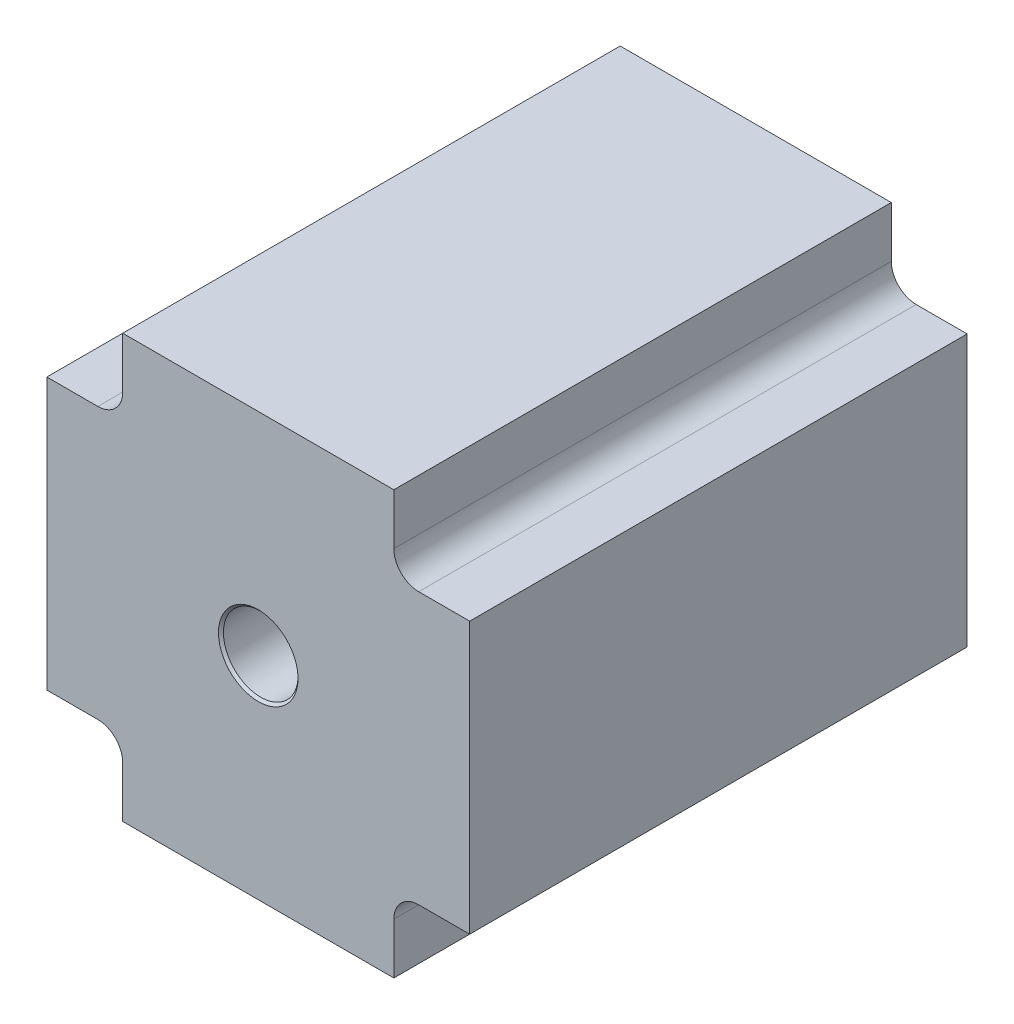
ISO-10303-21;
HEADER;
FILE_DESCRIPTION(('STEP AP214'),'2;1');
FILE_NAME('part.step','',(''),(''),'','','');
FILE_SCHEMA(('AUTOMOTIVE_DESIGN { 1 0 10303 214 1 1 1 1 }'));
ENDSEC;
DATA;
#1=APPLICATION_CONTEXT('core data for automotive mechanical design processes');
#2=APPLICATION_PROTOCOL_DEFINITION('international standard','automotive_design',2000,#1);
#3=PRODUCT_CONTEXT('',#1,'mechanical');
#4=PRODUCT('Part','Part','',(#3));
#5=PRODUCT_RELATED_PRODUCT_CATEGORY('part','',(#4));
#6=PRODUCT_DEFINITION_FORMATION('','',#4);
#7=PRODUCT_DEFINITION_CONTEXT('part definition',#1,'design');
#8=PRODUCT_DEFINITION('design','',#6,#7);
#9=PRODUCT_DEFINITION_SHAPE('','',#8);
#10=(LENGTH_UNIT() NAMED_UNIT(*) SI_UNIT(.MILLI.,.METRE.));
#11=(NAMED_UNIT(*) PLANE_ANGLE_UNIT() SI_UNIT($,.RADIAN.));
#12=(NAMED_UNIT(*) SI_UNIT($,.STERADIAN.) SOLID_ANGLE_UNIT());
#13=UNCERTAINTY_MEASURE_WITH_UNIT(LENGTH_MEASURE(1.E-05),#10,'distance_accuracy_value','');
#14=(GEOMETRIC_REPRESENTATION_CONTEXT(3) GLOBAL_UNCERTAINTY_ASSIGNED_CONTEXT((#13)) GLOBAL_UNIT_ASSIGNED_CONTEXT((#10,
#11,#12)) REPRESENTATION_CONTEXT('',''));
#15=CARTESIAN_POINT('',(0.,0.,0.));
#16=DIRECTION('',(0.,0.,1.));
#17=DIRECTION('',(1.,0.,0.));
#18=AXIS2_PLACEMENT_3D('',#15,#16,#17);
#19=CARTESIAN_POINT('',(-27.25,-27.25,100.));
#20=DIRECTION('',(1.,0.,0.));
#21=DIRECTION('',(0.,1.,0.));
#22=AXIS2_PLACEMENT_3D('',#19,#20,#21);
#23=PLANE('',#22);
#24=DIRECTION('',(0.,-1.,0.));
#25=VECTOR('',#24,1.);
#26=CARTESIAN_POINT('',(-27.25,-27.25,100.));
#27=LINE('',#26,#25);
#28=CARTESIAN_POINT('',(-27.25,-32.25,100.));
#29=VERTEX_POINT('',#28);
#30=CARTESIAN_POINT('',(-27.25,-42.5,100.));
#31=VERTEX_POINT('',#30);
#32=EDGE_CURVE('E149',#29,#31,#27,.T.);
#33=ORIENTED_EDGE('',*,*,#32,.F.);
#34=DIRECTION('',(0.,0.,-1.));
#35=VECTOR('',#34,1.);
#36=CARTESIAN_POINT('',(-27.25,-32.25,0.));
#37=LINE('',#36,#35);
#38=CARTESIAN_POINT('',(-27.25,-32.25,0.));
#39=VERTEX_POINT('',#38);
#40=EDGE_CURVE('E193',#29,#39,#37,.T.);
#41=ORIENTED_EDGE('',*,*,#40,.T.);
#42=DIRECTION('',(0.,-1.,0.));
#43=VECTOR('',#42,1.);
#44=CARTESIAN_POINT('',(-27.25,-27.25,0.));
#45=LINE('',#44,#43);
#46=CARTESIAN_POINT('',(-27.25,-42.5,0.));
#47=VERTEX_POINT('',#46);
#48=EDGE_CURVE('E174',#39,#47,#45,.T.);
#49=ORIENTED_EDGE('',*,*,#48,.T.);
#50=DIRECTION('',(0.,0.,-1.));
#51=VECTOR('',#50,1.);
#52=CARTESIAN_POINT('',(-27.25,-42.5,100.));
#53=LINE('',#52,#51);
#54=EDGE_CURVE('E167',#31,#47,#53,.T.);
#55=ORIENTED_EDGE('',*,*,#54,.F.);
#56=EDGE_LOOP('',(#33,#41,#49,#55));
#57=FACE_BOUND('',#56,.T.);
#58=ADVANCED_FACE('F37',(#57),#23,.F.);
#59=CARTESIAN_POINT('',(27.25,-42.5,100.));
#60=DIRECTION('',(0.,1.,0.));
#61=DIRECTION('',(-1.,0.,0.));
#62=AXIS2_PLACEMENT_3D('',#59,#60,#61);
#63=PLANE('',#62);
#64=DIRECTION('',(1.,0.,0.));
#65=VECTOR('',#64,1.);
#66=CARTESIAN_POINT('',(27.25,-42.5,0.));
#67=LINE('',#66,#65);
#68=CARTESIAN_POINT('',(27.25,-42.5,0.));
#69=VERTEX_POINT('',#68);
#70=EDGE_CURVE('E292',#47,#69,#67,.T.);
#71=ORIENTED_EDGE('',*,*,#70,.T.);
#72=DIRECTION('',(0.,0.,-1.));
#73=VECTOR('',#72,1.);
#74=CARTESIAN_POINT('',(27.25,-42.5,100.));
#75=LINE('',#74,#73);
#76=CARTESIAN_POINT('',(27.25,-42.5,100.));
#77=VERTEX_POINT('',#76);
#78=EDGE_CURVE('E169',#77,#69,#75,.T.);
#79=ORIENTED_EDGE('',*,*,#78,.F.);
#80=DIRECTION('',(1.,0.,0.));
#81=VECTOR('',#80,1.);
#82=CARTESIAN_POINT('',(27.25,-42.5,100.));
#83=LINE('',#82,#81);
#84=EDGE_CURVE('E154',#31,#77,#83,.T.);
#85=ORIENTED_EDGE('',*,*,#84,.F.);
#86=ORIENTED_EDGE('',*,*,#54,.T.);
#87=EDGE_LOOP('',(#71,#79,#85,#86));
#88=FACE_BOUND('',#87,.T.);
#89=ADVANCED_FACE('F166',(#88),#63,.F.);
#90=CARTESIAN_POINT('',(27.25,-27.25,100.));
#91=DIRECTION('',(-1.,0.,0.));
#92=DIRECTION('',(0.,0.,1.));
#93=AXIS2_PLACEMENT_3D('',#90,#91,#92);
#94=PLANE('',#93);
#95=DIRECTION('',(0.,1.,0.));
#96=VECTOR('',#95,1.);
#97=CARTESIAN_POINT('',(27.25,-27.25,0.));
#98=LINE('',#97,#96);
#99=CARTESIAN_POINT('',(27.25,-32.25,0.));
#100=VERTEX_POINT('',#99);
#101=EDGE_CURVE('E291',#69,#100,#98,.T.);
#102=ORIENTED_EDGE('',*,*,#101,.T.);
#103=DIRECTION('',(0.,0.,-1.));
#104=VECTOR('',#103,1.);
#105=CARTESIAN_POINT('',(27.25,-32.25,100.));
#106=LINE('',#105,#104);
#107=CARTESIAN_POINT('',(27.25,-32.25,100.));
#108=VERTEX_POINT('',#107);
#109=EDGE_CURVE('E200',#100,#108,#106,.F.);
#110=ORIENTED_EDGE('',*,*,#109,.T.);
#111=DIRECTION('',(0.,1.,0.));
#112=VECTOR('',#111,1.);
#113=CARTESIAN_POINT('',(27.25,-27.25,100.));
#114=LINE('',#113,#112);
#115=EDGE_CURVE('E171',#77,#108,#114,.T.);
#116=ORIENTED_EDGE('',*,*,#115,.F.);
#117=ORIENTED_EDGE('',*,*,#78,.T.);
#118=EDGE_LOOP('',(#102,#110,#116,#117));
#119=FACE_BOUND('',#118,.T.);
#120=ADVANCED_FACE('F317',(#119),#94,.F.);
#121=CARTESIAN_POINT('',(42.5,-27.25,100.));
#122=DIRECTION('',(0.,1.,0.));
#123=DIRECTION('',(0.,0.,1.));
#124=AXIS2_PLACEMENT_3D('',#121,#122,#123);
#125=PLANE('',#124);
#126=DIRECTION('',(1.,0.,0.));
#127=VECTOR('',#126,1.);
#128=CARTESIAN_POINT('',(42.5,-27.25,100.));
#129=LINE('',#128,#127);
#130=CARTESIAN_POINT('',(32.25,-27.25,100.));
#131=VERTEX_POINT('',#130);
#132=CARTESIAN_POINT('',(42.5,-27.25,100.));
#133=VERTEX_POINT('',#132);
#134=EDGE_CURVE('E307',#131,#133,#129,.T.);
#135=ORIENTED_EDGE('',*,*,#134,.F.);
#136=DIRECTION('',(0.,0.,-1.));
#137=VECTOR('',#136,1.);
#138=CARTESIAN_POINT('',(32.25,-27.25,0.));
#139=LINE('',#138,#137);
#140=CARTESIAN_POINT('',(32.25,-27.25,0.));
#141=VERTEX_POINT('',#140);
#142=EDGE_CURVE('E197',#131,#141,#139,.T.);
#143=ORIENTED_EDGE('',*,*,#142,.T.);
#144=DIRECTION('',(1.,0.,0.));
#145=VECTOR('',#144,1.);
#146=CARTESIAN_POINT('',(42.5,-27.25,0.));
#147=LINE('',#146,#145);
#148=CARTESIAN_POINT('',(42.5,-27.25,0.));
#149=VERTEX_POINT('',#148);
#150=EDGE_CURVE('E256',#141,#149,#147,.T.);
#151=ORIENTED_EDGE('',*,*,#150,.T.);
#152=DIRECTION('',(0.,0.,-1.));
#153=VECTOR('',#152,1.);
#154=CARTESIAN_POINT('',(42.5,-27.25,100.));
#155=LINE('',#154,#153);
#156=EDGE_CURVE('E181',#133,#149,#155,.T.);
#157=ORIENTED_EDGE('',*,*,#156,.F.);
#158=EDGE_LOOP('',(#135,#143,#151,#157));
#159=FACE_BOUND('',#158,.T.);
#160=ADVANCED_FACE('F315',(#159),#125,.F.);
#161=CARTESIAN_POINT('',(42.5,-27.25,100.));
#162=DIRECTION('',(-1.,0.,0.));
#163=DIRECTION('',(0.,0.,1.));
#164=AXIS2_PLACEMENT_3D('',#161,#162,#163);
#165=PLANE('',#164);
#166=DIRECTION('',(0.,1.,0.));
#167=VECTOR('',#166,1.);
#168=CARTESIAN_POINT('',(42.5,-27.25,0.));
#169=LINE('',#168,#167);
#170=CARTESIAN_POINT('',(42.5,27.25,0.));
#171=VERTEX_POINT('',#170);
#172=EDGE_CURVE('E252',#149,#171,#169,.T.);
#173=ORIENTED_EDGE('',*,*,#172,.T.);
#174=DIRECTION('',(0.,0.,-1.));
#175=VECTOR('',#174,1.);
#176=CARTESIAN_POINT('',(42.5,27.25,100.));
#177=LINE('',#176,#175);
#178=CARTESIAN_POINT('',(42.5,27.25,100.));
#179=VERTEX_POINT('',#178);
#180=EDGE_CURVE('E251',#179,#171,#177,.T.);
#181=ORIENTED_EDGE('',*,*,#180,.F.);
#182=DIRECTION('',(0.,1.,0.));
#183=VECTOR('',#182,1.);
#184=CARTESIAN_POINT('',(42.5,-27.25,100.));
#185=LINE('',#184,#183);
#186=EDGE_CURVE('E285',#133,#179,#185,.T.);
#187=ORIENTED_EDGE('',*,*,#186,.F.);
#188=ORIENTED_EDGE('',*,*,#156,.T.);
#189=EDGE_LOOP('',(#173,#181,#187,#188));
#190=FACE_BOUND('',#189,.T.);
#191=ADVANCED_FACE('F284',(#190),#165,.F.);
#192=CARTESIAN_POINT('',(42.5,27.25,100.));
#193=DIRECTION('',(0.,-1.,0.));
#194=DIRECTION('',(1.,0.,0.));
#195=AXIS2_PLACEMENT_3D('',#192,#193,#194);
#196=PLANE('',#195);
#197=DIRECTION('',(-1.,0.,0.));
#198=VECTOR('',#197,1.);
#199=CARTESIAN_POINT('',(42.5,27.25,0.));
#200=LINE('',#199,#198);
#201=CARTESIAN_POINT('',(32.25,27.25,0.));
#202=VERTEX_POINT('',#201);
#203=EDGE_CURVE('E244',#171,#202,#200,.T.);
#204=ORIENTED_EDGE('',*,*,#203,.T.);
#205=DIRECTION('',(0.,0.,-1.));
#206=VECTOR('',#205,1.);
#207=CARTESIAN_POINT('',(32.25,27.25,100.));
#208=LINE('',#207,#206);
#209=CARTESIAN_POINT('',(32.25,27.25,100.));
#210=VERTEX_POINT('',#209);
#211=EDGE_CURVE('E205',#202,#210,#208,.F.);
#212=ORIENTED_EDGE('',*,*,#211,.T.);
#213=DIRECTION('',(-1.,0.,0.));
#214=VECTOR('',#213,1.);
#215=CARTESIAN_POINT('',(42.5,27.25,100.));
#216=LINE('',#215,#214);
#217=EDGE_CURVE('E227',#179,#210,#216,.T.);
#218=ORIENTED_EDGE('',*,*,#217,.F.);
#219=ORIENTED_EDGE('',*,*,#180,.T.);
#220=EDGE_LOOP('',(#204,#212,#218,#219));
#221=FACE_BOUND('',#220,.T.);
#222=ADVANCED_FACE('F249',(#221),#196,.F.);
#223=CARTESIAN_POINT('',(27.25,42.5,100.));
#224=DIRECTION('',(-1.,0.,0.));
#225=DIRECTION('',(0.,-1.,0.));
#226=AXIS2_PLACEMENT_3D('',#223,#224,#225);
#227=PLANE('',#226);
#228=DIRECTION('',(0.,1.,0.));
#229=VECTOR('',#228,1.);
#230=CARTESIAN_POINT('',(27.25,42.5,100.));
#231=LINE('',#230,#229);
#232=CARTESIAN_POINT('',(27.25,32.25,100.));
#233=VERTEX_POINT('',#232);
#234=CARTESIAN_POINT('',(27.25,42.5,100.));
#235=VERTEX_POINT('',#234);
#236=EDGE_CURVE('E224',#233,#235,#231,.T.);
#237=ORIENTED_EDGE('',*,*,#236,.F.);
#238=DIRECTION('',(0.,0.,-1.));
#239=VECTOR('',#238,1.);
#240=CARTESIAN_POINT('',(27.25,32.25,0.));
#241=LINE('',#240,#239);
#242=CARTESIAN_POINT('',(27.25,32.25,0.));
#243=VERTEX_POINT('',#242);
#244=EDGE_CURVE('E202',#233,#243,#241,.T.);
#245=ORIENTED_EDGE('',*,*,#244,.T.);
#246=DIRECTION('',(0.,1.,0.));
#247=VECTOR('',#246,1.);
#248=CARTESIAN_POINT('',(27.25,42.5,0.));
#249=LINE('',#248,#247);
#250=CARTESIAN_POINT('',(27.25,42.5,0.));
#251=VERTEX_POINT('',#250);
#252=EDGE_CURVE('E246',#243,#251,#249,.T.);
#253=ORIENTED_EDGE('',*,*,#252,.T.);
#254=DIRECTION('',(0.,0.,-1.));
#255=VECTOR('',#254,1.);
#256=CARTESIAN_POINT('',(27.25,42.5,100.));
#257=LINE('',#256,#255);
#258=EDGE_CURVE('E235',#235,#251,#257,.T.);
#259=ORIENTED_EDGE('',*,*,#258,.F.);
#260=EDGE_LOOP('',(#237,#245,#253,#259));
#261=FACE_BOUND('',#260,.T.);
#262=ADVANCED_FACE('F232',(#261),#227,.F.);
#263=CARTESIAN_POINT('',(27.25,42.5,100.));
#264=DIRECTION('',(0.,-1.,0.));
#265=DIRECTION('',(1.,0.,0.));
#266=AXIS2_PLACEMENT_3D('',#263,#264,#265);
#267=PLANE('',#266);
#268=DIRECTION('',(-1.,0.,0.));
#269=VECTOR('',#268,1.);
#270=CARTESIAN_POINT('',(27.25,42.5,0.));
#271=LINE('',#270,#269);
#272=CARTESIAN_POINT('',(-27.25,42.5,0.));
#273=VERTEX_POINT('',#272);
#274=EDGE_CURVE('E254',#251,#273,#271,.T.);
#275=ORIENTED_EDGE('',*,*,#274,.T.);
#276=DIRECTION('',(0.,0.,-1.));
#277=VECTOR('',#276,1.);
#278=CARTESIAN_POINT('',(-27.25,42.5,100.));
#279=LINE('',#278,#277);
#280=CARTESIAN_POINT('',(-27.25,42.5,100.));
#281=VERTEX_POINT('',#280);
#282=EDGE_CURVE('E276',#281,#273,#279,.T.);
#283=ORIENTED_EDGE('',*,*,#282,.F.);
#284=DIRECTION('',(-1.,0.,0.));
#285=VECTOR('',#284,1.);
#286=CARTESIAN_POINT('',(27.25,42.5,100.));
#287=LINE('',#286,#285);
#288=EDGE_CURVE('E237',#235,#281,#287,.T.);
#289=ORIENTED_EDGE('',*,*,#288,.F.);
#290=ORIENTED_EDGE('',*,*,#258,.T.);
#291=EDGE_LOOP('',(#275,#283,#289,#290));
#292=FACE_BOUND('',#291,.T.);
#293=ADVANCED_FACE('F385',(#292),#267,.F.);
#294=CARTESIAN_POINT('',(-27.25,42.5,100.));
#295=DIRECTION('',(1.,0.,0.));
#296=DIRECTION('',(0.,0.,-1.));
#297=AXIS2_PLACEMENT_3D('',#294,#295,#296);
#298=PLANE('',#297);
#299=DIRECTION('',(0.,-1.,0.));
#300=VECTOR('',#299,1.);
#301=CARTESIAN_POINT('',(-27.25,42.5,0.));
#302=LINE('',#301,#300);
#303=CARTESIAN_POINT('',(-27.25,32.25,0.));
#304=VERTEX_POINT('',#303);
#305=EDGE_CURVE('E261',#273,#304,#302,.T.);
#306=ORIENTED_EDGE('',*,*,#305,.T.);
#307=DIRECTION('',(0.,0.,-1.));
#308=VECTOR('',#307,1.);
#309=CARTESIAN_POINT('',(-27.25,32.25,100.));
#310=LINE('',#309,#308);
#311=CARTESIAN_POINT('',(-27.25,32.25,100.));
#312=VERTEX_POINT('',#311);
#313=EDGE_CURVE('E52',#304,#312,#310,.F.);
#314=ORIENTED_EDGE('',*,*,#313,.T.);
#315=DIRECTION('',(0.,-1.,0.));
#316=VECTOR('',#315,1.);
#317=CARTESIAN_POINT('',(-27.25,42.5,100.));
#318=LINE('',#317,#316);
#319=EDGE_CURVE('E302',#281,#312,#318,.T.);
#320=ORIENTED_EDGE('',*,*,#319,.F.);
#321=ORIENTED_EDGE('',*,*,#282,.T.);
#322=EDGE_LOOP('',(#306,#314,#320,#321));
#323=FACE_BOUND('',#322,.T.);
#324=ADVANCED_FACE('F382',(#323),#298,.F.);
#325=CARTESIAN_POINT('',(-27.25,27.25,100.));
#326=DIRECTION('',(0.,-1.,0.));
#327=DIRECTION('',(0.,0.,-1.));
#328=AXIS2_PLACEMENT_3D('',#325,#326,#327);
#329=PLANE('',#328);
#330=DIRECTION('',(-1.,0.,0.));
#331=VECTOR('',#330,1.);
#332=CARTESIAN_POINT('',(-27.25,27.25,100.));
#333=LINE('',#332,#331);
#334=CARTESIAN_POINT('',(-32.25,27.25,100.));
#335=VERTEX_POINT('',#334);
#336=CARTESIAN_POINT('',(-42.5,27.25,100.));
#337=VERTEX_POINT('',#336);
#338=EDGE_CURVE('E300',#335,#337,#333,.T.);
#339=ORIENTED_EDGE('',*,*,#338,.F.);
#340=DIRECTION('',(0.,0.,-1.));
#341=VECTOR('',#340,1.);
#342=CARTESIAN_POINT('',(-32.25,27.25,0.));
#343=LINE('',#342,#341);
#344=CARTESIAN_POINT('',(-32.25,27.25,0.));
#345=VERTEX_POINT('',#344);
#346=EDGE_CURVE('E207',#335,#345,#343,.T.);
#347=ORIENTED_EDGE('',*,*,#346,.T.);
#348=DIRECTION('',(-1.,0.,0.));
#349=VECTOR('',#348,1.);
#350=CARTESIAN_POINT('',(-27.25,27.25,0.));
#351=LINE('',#350,#349);
#352=CARTESIAN_POINT('',(-42.5,27.25,0.));
#353=VERTEX_POINT('',#352);
#354=EDGE_CURVE('E263',#345,#353,#351,.T.);
#355=ORIENTED_EDGE('',*,*,#354,.T.);
#356=DIRECTION('',(0.,0.,-1.));
#357=VECTOR('',#356,1.);
#358=CARTESIAN_POINT('',(-42.5,27.25,100.));
#359=LINE('',#358,#357);
#360=EDGE_CURVE('E272',#337,#353,#359,.T.);
#361=ORIENTED_EDGE('',*,*,#360,.F.);
#362=EDGE_LOOP('',(#339,#347,#355,#361));
#363=FACE_BOUND('',#362,.T.);
#364=ADVANCED_FACE('F358',(#363),#329,.F.);
#365=CARTESIAN_POINT('',(-42.5,-27.25,100.));
#366=DIRECTION('',(1.,0.,0.));
#367=DIRECTION('',(0.,0.,-1.));
#368=AXIS2_PLACEMENT_3D('',#365,#366,#367);
#369=PLANE('',#368);
#370=DIRECTION('',(0.,-1.,0.));
#371=VECTOR('',#370,1.);
#372=CARTESIAN_POINT('',(-42.5,-27.25,0.));
#373=LINE('',#372,#371);
#374=CARTESIAN_POINT('',(-42.5,-27.25,0.));
#375=VERTEX_POINT('',#374);
#376=EDGE_CURVE('E265',#353,#375,#373,.T.);
#377=ORIENTED_EDGE('',*,*,#376,.T.);
#378=DIRECTION('',(0.,0.,-1.));
#379=VECTOR('',#378,1.);
#380=CARTESIAN_POINT('',(-42.5,-27.25,100.));
#381=LINE('',#380,#379);
#382=CARTESIAN_POINT('',(-42.5,-27.25,100.));
#383=VERTEX_POINT('',#382);
#384=EDGE_CURVE('E269',#383,#375,#381,.T.);
#385=ORIENTED_EDGE('',*,*,#384,.F.);
#386=DIRECTION('',(0.,-1.,0.));
#387=VECTOR('',#386,1.);
#388=CARTESIAN_POINT('',(-42.5,-27.25,100.));
#389=LINE('',#388,#387);
#390=EDGE_CURVE('E298',#337,#383,#389,.T.);
#391=ORIENTED_EDGE('',*,*,#390,.F.);
#392=ORIENTED_EDGE('',*,*,#360,.T.);
#393=EDGE_LOOP('',(#377,#385,#391,#392));
#394=FACE_BOUND('',#393,.T.);
#395=ADVANCED_FACE('F363',(#394),#369,.F.);
#396=CARTESIAN_POINT('',(-27.25,-27.25,100.));
#397=DIRECTION('',(0.,1.,0.));
#398=DIRECTION('',(-1.,0.,0.));
#399=AXIS2_PLACEMENT_3D('',#396,#397,#398);
#400=PLANE('',#399);
#401=DIRECTION('',(1.,0.,0.));
#402=VECTOR('',#401,1.);
#403=CARTESIAN_POINT('',(-27.25,-27.25,0.));
#404=LINE('',#403,#402);
#405=CARTESIAN_POINT('',(-32.25,-27.25,0.));
#406=VERTEX_POINT('',#405);
#407=EDGE_CURVE('E162',#375,#406,#404,.T.);
#408=ORIENTED_EDGE('',*,*,#407,.T.);
#409=DIRECTION('',(0.,0.,-1.));
#410=VECTOR('',#409,1.);
#411=CARTESIAN_POINT('',(-32.25,-27.25,100.));
#412=LINE('',#411,#410);
#413=CARTESIAN_POINT('',(-32.25,-27.25,100.));
#414=VERTEX_POINT('',#413);
#415=EDGE_CURVE('E195',#406,#414,#412,.F.);
#416=ORIENTED_EDGE('',*,*,#415,.T.);
#417=DIRECTION('',(1.,0.,0.));
#418=VECTOR('',#417,1.);
#419=CARTESIAN_POINT('',(-27.25,-27.25,100.));
#420=LINE('',#419,#418);
#421=EDGE_CURVE('E273',#383,#414,#420,.T.);
#422=ORIENTED_EDGE('',*,*,#421,.F.);
#423=ORIENTED_EDGE('',*,*,#384,.T.);
#424=EDGE_LOOP('',(#408,#416,#422,#423));
#425=FACE_BOUND('',#424,.T.);
#426=ADVANCED_FACE('F368',(#425),#400,.F.);
#427=CARTESIAN_POINT('',(0.,0.,100.));
#428=DIRECTION('',(0.,0.,-1.));
#429=DIRECTION('',(-1.,0.,0.));
#430=AXIS2_PLACEMENT_3D('',#427,#428,#429);
#431=PLANE('',#430);
#432=CARTESIAN_POINT('',(0.,0.,100.));
#433=DIRECTION('',(0.,0.,-1.));
#434=DIRECTION('',(-1.,0.,0.));
#435=AXIS2_PLACEMENT_3D('',#432,#433,#434);
#436=CIRCLE('',#435,8.00000000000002);
#437=CARTESIAN_POINT('',(-8.00000000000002,0.,100.));
#438=VERTEX_POINT('',#437);
#439=EDGE_CURVE('E190',#438,#438,#436,.T.);
#440=ORIENTED_EDGE('',*,*,#439,.T.);
#441=EDGE_LOOP('',(#440));
#442=FACE_BOUND('',#441,.T.);
#443=ORIENTED_EDGE('',*,*,#421,.T.);
#444=CARTESIAN_POINT('',(-32.25,-32.25,100.));
#445=DIRECTION('',(0.,0.,-1.));
#446=DIRECTION('',(-1.,0.,0.));
#447=AXIS2_PLACEMENT_3D('',#444,#445,#446);
#448=CIRCLE('',#447,5.);
#449=EDGE_CURVE('E157',#414,#29,#448,.T.);
#450=ORIENTED_EDGE('',*,*,#449,.T.);
#451=ORIENTED_EDGE('',*,*,#32,.T.);
#452=ORIENTED_EDGE('',*,*,#84,.T.);
#453=ORIENTED_EDGE('',*,*,#115,.T.);
#454=CARTESIAN_POINT('',(32.25,-32.25,100.));
#455=DIRECTION('',(0.,0.,-1.));
#456=DIRECTION('',(-1.,0.,0.));
#457=AXIS2_PLACEMENT_3D('',#454,#455,#456);
#458=CIRCLE('',#457,5.);
#459=EDGE_CURVE('E216',#108,#131,#458,.T.);
#460=ORIENTED_EDGE('',*,*,#459,.T.);
#461=ORIENTED_EDGE('',*,*,#134,.T.);
#462=ORIENTED_EDGE('',*,*,#186,.T.);
#463=ORIENTED_EDGE('',*,*,#217,.T.);
#464=CARTESIAN_POINT('',(32.25,32.25,100.));
#465=DIRECTION('',(0.,0.,-1.));
#466=DIRECTION('',(-1.,0.,0.));
#467=AXIS2_PLACEMENT_3D('',#464,#465,#466);
#468=CIRCLE('',#467,5.);
#469=EDGE_CURVE('E220',#210,#233,#468,.T.);
#470=ORIENTED_EDGE('',*,*,#469,.T.);
#471=ORIENTED_EDGE('',*,*,#236,.T.);
#472=ORIENTED_EDGE('',*,*,#288,.T.);
#473=ORIENTED_EDGE('',*,*,#319,.T.);
#474=CARTESIAN_POINT('',(-32.25,32.25,100.));
#475=DIRECTION('',(0.,0.,-1.));
#476=DIRECTION('',(-1.,0.,0.));
#477=AXIS2_PLACEMENT_3D('',#474,#475,#476);
#478=CIRCLE('',#477,5.);
#479=EDGE_CURVE('E11',#312,#335,#478,.T.);
#480=ORIENTED_EDGE('',*,*,#479,.T.);
#481=ORIENTED_EDGE('',*,*,#338,.T.);
#482=ORIENTED_EDGE('',*,*,#390,.T.);
#483=EDGE_LOOP('',(#443,#450,#451,#452,#453,#460,#461,#462,#463,#470,#471,#472,#473,#480,#481,#482));
#484=FACE_BOUND('',#483,.T.);
#485=ADVANCED_FACE('F152',(#442,#484),#431,.F.);
#486=CARTESIAN_POINT('',(0.,0.,0.));
#487=DIRECTION('',(0.,0.,-1.));
#488=DIRECTION('',(-1.,0.,0.));
#489=AXIS2_PLACEMENT_3D('',#486,#487,#488);
#490=PLANE('',#489);
#491=CARTESIAN_POINT('',(0.,0.,0.));
#492=DIRECTION('',(0.,0.,-1.));
#493=DIRECTION('',(-1.,0.,0.));
#494=AXIS2_PLACEMENT_3D('',#491,#492,#493);
#495=CIRCLE('',#494,8.00000000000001);
#496=CARTESIAN_POINT('',(-8.00000000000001,0.,0.));
#497=VERTEX_POINT('',#496);
#498=EDGE_CURVE('E176',#497,#497,#495,.F.);
#499=ORIENTED_EDGE('',*,*,#498,.T.);
#500=EDGE_LOOP('',(#499));
#501=FACE_BOUND('',#500,.T.);
#502=ORIENTED_EDGE('',*,*,#48,.F.);
#503=CARTESIAN_POINT('',(-32.25,-32.25,0.));
#504=DIRECTION('',(0.,0.,-1.));
#505=DIRECTION('',(-1.,0.,0.));
#506=AXIS2_PLACEMENT_3D('',#503,#504,#505);
#507=CIRCLE('',#506,5.);
#508=EDGE_CURVE('E211',#39,#406,#507,.F.);
#509=ORIENTED_EDGE('',*,*,#508,.T.);
#510=ORIENTED_EDGE('',*,*,#407,.F.);
#511=ORIENTED_EDGE('',*,*,#376,.F.);
#512=ORIENTED_EDGE('',*,*,#354,.F.);
#513=CARTESIAN_POINT('',(-32.25,32.25,0.));
#514=DIRECTION('',(0.,0.,-1.));
#515=DIRECTION('',(-1.,0.,0.));
#516=AXIS2_PLACEMENT_3D('',#513,#514,#515);
#517=CIRCLE('',#516,5.);
#518=EDGE_CURVE('E45',#345,#304,#517,.F.);
#519=ORIENTED_EDGE('',*,*,#518,.T.);
#520=ORIENTED_EDGE('',*,*,#305,.F.);
#521=ORIENTED_EDGE('',*,*,#274,.F.);
#522=ORIENTED_EDGE('',*,*,#252,.F.);
#523=CARTESIAN_POINT('',(32.25,32.25,0.));
#524=DIRECTION('',(0.,0.,-1.));
#525=DIRECTION('',(-1.,0.,0.));
#526=AXIS2_PLACEMENT_3D('',#523,#524,#525);
#527=CIRCLE('',#526,5.);
#528=EDGE_CURVE('E218',#243,#202,#527,.F.);
#529=ORIENTED_EDGE('',*,*,#528,.T.);
#530=ORIENTED_EDGE('',*,*,#203,.F.);
#531=ORIENTED_EDGE('',*,*,#172,.F.);
#532=ORIENTED_EDGE('',*,*,#150,.F.);
#533=CARTESIAN_POINT('',(32.25,-32.25,0.));
#534=DIRECTION('',(0.,0.,-1.));
#535=DIRECTION('',(-1.,0.,0.));
#536=AXIS2_PLACEMENT_3D('',#533,#534,#535);
#537=CIRCLE('',#536,5.);
#538=EDGE_CURVE('E214',#141,#100,#537,.F.);
#539=ORIENTED_EDGE('',*,*,#538,.T.);
#540=ORIENTED_EDGE('',*,*,#101,.F.);
#541=ORIENTED_EDGE('',*,*,#70,.F.);
#542=EDGE_LOOP('',(#502,#509,#510,#511,#512,#519,#520,#521,#522,#529,#530,#531,#532,#539,#540,#541));
#543=FACE_BOUND('',#542,.T.);
#544=ADVANCED_FACE('F242',(#501,#543),#490,.T.);
#545=CARTESIAN_POINT('',(0.,0.,0.));
#546=DIRECTION('',(0.,0.,1.));
#547=DIRECTION('',(1.,0.,0.));
#548=AXIS2_PLACEMENT_3D('',#545,#546,#547);
#549=CYLINDRICAL_SURFACE('',#548,7.5);
#550=CARTESIAN_POINT('',(0.,0.,0.500000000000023));
#551=DIRECTION('',(0.,0.,-1.));
#552=DIRECTION('',(-1.,0.,0.));
#553=AXIS2_PLACEMENT_3D('',#550,#551,#552);
#554=CIRCLE('',#553,7.5);
#555=CARTESIAN_POINT('',(-7.5,0.,0.500000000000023));
#556=VERTEX_POINT('',#555);
#557=EDGE_CURVE('E187',#556,#556,#554,.T.);
#558=ORIENTED_EDGE('',*,*,#557,.T.);
#559=EDGE_LOOP('',(#558));
#560=FACE_BOUND('',#559,.T.);
#561=CARTESIAN_POINT('',(0.,0.,99.5));
#562=DIRECTION('',(0.,0.,-1.));
#563=DIRECTION('',(-1.,0.,0.));
#564=AXIS2_PLACEMENT_3D('',#561,#562,#563);
#565=CIRCLE('',#564,7.5);
#566=CARTESIAN_POINT('',(-7.5,0.,99.5));
#567=VERTEX_POINT('',#566);
#568=EDGE_CURVE('E179',#567,#567,#565,.F.);
#569=ORIENTED_EDGE('',*,*,#568,.T.);
#570=EDGE_LOOP('',(#569));
#571=FACE_BOUND('',#570,.T.);
#572=ADVANCED_FACE('F336',(#560,#571),#549,.F.);
#573=CARTESIAN_POINT('',(0.,0.,0.));
#574=DIRECTION('',(0.,0.,-1.));
#575=DIRECTION('',(-1.,0.,0.));
#576=AXIS2_PLACEMENT_3D('',#573,#574,#575);
#577=CONICAL_SURFACE('',#576,8.00000000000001,0.785398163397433);
#578=ORIENTED_EDGE('',*,*,#557,.F.);
#579=EDGE_LOOP('',(#578));
#580=FACE_BOUND('',#579,.T.);
#581=ORIENTED_EDGE('',*,*,#498,.F.);
#582=EDGE_LOOP('',(#581));
#583=FACE_BOUND('',#582,.T.);
#584=ADVANCED_FACE('F332',(#580,#583),#577,.F.);
#585=CARTESIAN_POINT('',(0.,0.,99.5));
#586=DIRECTION('',(0.,0.,1.));
#587=DIRECTION('',(1.,0.,0.));
#588=AXIS2_PLACEMENT_3D('',#585,#586,#587);
#589=CONICAL_SURFACE('',#588,7.5,0.785398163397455);
#590=ORIENTED_EDGE('',*,*,#439,.F.);
#591=EDGE_LOOP('',(#590));
#592=FACE_BOUND('',#591,.T.);
#593=ORIENTED_EDGE('',*,*,#568,.F.);
#594=EDGE_LOOP('',(#593));
#595=FACE_BOUND('',#594,.T.);
#596=ADVANCED_FACE('F335',(#592,#595),#589,.F.);
#597=CARTESIAN_POINT('',(-32.25,-32.25,100.));
#598=DIRECTION('',(0.,0.,1.));
#599=DIRECTION('',(1.,0.,0.));
#600=AXIS2_PLACEMENT_3D('',#597,#598,#599);
#601=CYLINDRICAL_SURFACE('',#600,5.);
#602=ORIENTED_EDGE('',*,*,#449,.F.);
#603=ORIENTED_EDGE('',*,*,#415,.F.);
#604=ORIENTED_EDGE('',*,*,#508,.F.);
#605=ORIENTED_EDGE('',*,*,#40,.F.);
#606=EDGE_LOOP('',(#602,#603,#604,#605));
#607=FACE_BOUND('',#606,.T.);
#608=ADVANCED_FACE('F340',(#607),#601,.F.);
#609=CARTESIAN_POINT('',(32.25,-32.25,100.));
#610=DIRECTION('',(0.,0.,1.));
#611=DIRECTION('',(1.,0.,0.));
#612=AXIS2_PLACEMENT_3D('',#609,#610,#611);
#613=CYLINDRICAL_SURFACE('',#612,5.);
#614=ORIENTED_EDGE('',*,*,#459,.F.);
#615=ORIENTED_EDGE('',*,*,#109,.F.);
#616=ORIENTED_EDGE('',*,*,#538,.F.);
#617=ORIENTED_EDGE('',*,*,#142,.F.);
#618=EDGE_LOOP('',(#614,#615,#616,#617));
#619=FACE_BOUND('',#618,.T.);
#620=ADVANCED_FACE('F314',(#619),#613,.F.);
#621=CARTESIAN_POINT('',(32.25,32.25,100.));
#622=DIRECTION('',(0.,0.,1.));
#623=DIRECTION('',(1.,0.,0.));
#624=AXIS2_PLACEMENT_3D('',#621,#622,#623);
#625=CYLINDRICAL_SURFACE('',#624,5.);
#626=ORIENTED_EDGE('',*,*,#469,.F.);
#627=ORIENTED_EDGE('',*,*,#211,.F.);
#628=ORIENTED_EDGE('',*,*,#528,.F.);
#629=ORIENTED_EDGE('',*,*,#244,.F.);
#630=EDGE_LOOP('',(#626,#627,#628,#629));
#631=FACE_BOUND('',#630,.T.);
#632=ADVANCED_FACE('F239',(#631),#625,.F.);
#633=CARTESIAN_POINT('',(-32.25,32.25,100.));
#634=DIRECTION('',(0.,0.,1.));
#635=DIRECTION('',(1.,0.,0.));
#636=AXIS2_PLACEMENT_3D('',#633,#634,#635);
#637=CYLINDRICAL_SURFACE('',#636,5.);
#638=ORIENTED_EDGE('',*,*,#479,.F.);
#639=ORIENTED_EDGE('',*,*,#313,.F.);
#640=ORIENTED_EDGE('',*,*,#518,.F.);
#641=ORIENTED_EDGE('',*,*,#346,.F.);
#642=EDGE_LOOP('',(#638,#639,#640,#641));
#643=FACE_BOUND('',#642,.T.);
#644=ADVANCED_FACE('F39',(#643),#637,.F.);
#645=CLOSED_SHELL('',(#58,#89,#120,#160,#191,#222,#262,#293,#324,#364,#395,#426,#485,#544,#572,
#584,#596,#608,#620,#632,#644));
#646=MANIFOLD_SOLID_BREP('B2',#645);
#647=ADVANCED_BREP_SHAPE_REPRESENTATION('',(#18,#646),#14);
#648=SHAPE_DEFINITION_REPRESENTATION(#9,#647);
ENDSEC;
END-ISO-10303-21;
